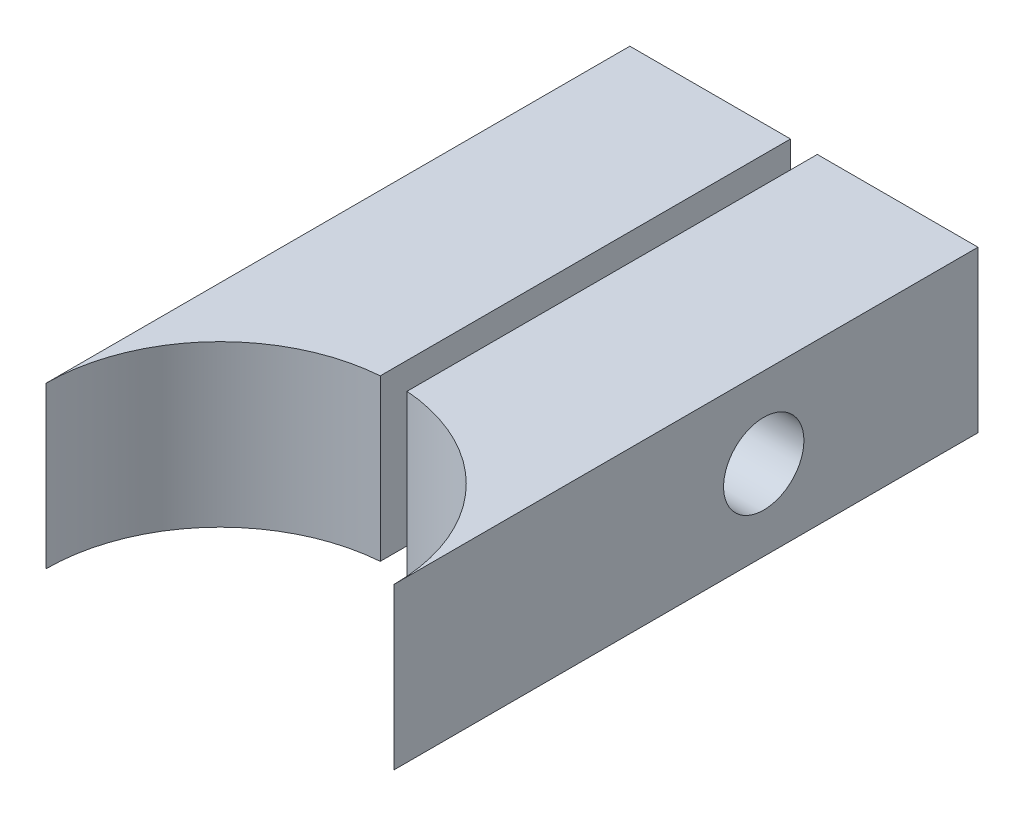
ISO-10303-21;
HEADER;
FILE_DESCRIPTION(('STEP AP214'),'2;1');
FILE_NAME('part.step','',(''),(''),'','','');
FILE_SCHEMA(('AUTOMOTIVE_DESIGN { 1 0 10303 214 1 1 1 1 }'));
ENDSEC;
DATA;
#1=APPLICATION_CONTEXT('core data for automotive mechanical design processes');
#2=APPLICATION_PROTOCOL_DEFINITION('international standard','automotive_design',2000,#1);
#3=PRODUCT_CONTEXT('',#1,'mechanical');
#4=PRODUCT('Part','Part','',(#3));
#5=PRODUCT_RELATED_PRODUCT_CATEGORY('part','',(#4));
#6=PRODUCT_DEFINITION_FORMATION('','',#4);
#7=PRODUCT_DEFINITION_CONTEXT('part definition',#1,'design');
#8=PRODUCT_DEFINITION('design','',#6,#7);
#9=PRODUCT_DEFINITION_SHAPE('','',#8);
#10=(LENGTH_UNIT() NAMED_UNIT(*) SI_UNIT(.MILLI.,.METRE.));
#11=(NAMED_UNIT(*) PLANE_ANGLE_UNIT() SI_UNIT($,.RADIAN.));
#12=(NAMED_UNIT(*) SI_UNIT($,.STERADIAN.) SOLID_ANGLE_UNIT());
#13=UNCERTAINTY_MEASURE_WITH_UNIT(LENGTH_MEASURE(1.E-05),#10,'distance_accuracy_value','');
#14=(GEOMETRIC_REPRESENTATION_CONTEXT(3) GLOBAL_UNCERTAINTY_ASSIGNED_CONTEXT((#13)) GLOBAL_UNIT_ASSIGNED_CONTEXT((#10,
#11,#12)) REPRESENTATION_CONTEXT('',''));
#15=CARTESIAN_POINT('',(0.,0.,0.));
#16=DIRECTION('',(0.,0.,1.));
#17=DIRECTION('',(1.,0.,0.));
#18=AXIS2_PLACEMENT_3D('',#15,#16,#17);
#19=CARTESIAN_POINT('',(20.5288565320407,6.,21.1643132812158));
#20=DIRECTION('',(0.,-1.,0.));
#21=DIRECTION('',(0.,0.,-1.));
#22=AXIS2_PLACEMENT_3D('',#19,#20,#21);
#23=CYLINDRICAL_SURFACE('',#22,6.49999999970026);
#24=CARTESIAN_POINT('',(20.5288565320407,0.,21.1643132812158));
#25=DIRECTION('',(0.,-1.,0.));
#26=DIRECTION('',(0.,0.,1.));
#27=AXIS2_PLACEMENT_3D('',#24,#25,#26);
#28=CIRCLE('',#27,6.49999999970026);
#29=CARTESIAN_POINT('',(21.0288565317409,0.,14.6835725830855));
#30=VERTEX_POINT('',#29);
#31=CARTESIAN_POINT('',(27.0288565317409,0.,21.1643132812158));
#32=VERTEX_POINT('',#31);
#33=EDGE_CURVE('E110',#30,#32,#28,.T.);
#34=ORIENTED_EDGE('',*,*,#33,.T.);
#35=DIRECTION('',(0.,-1.,0.));
#36=VECTOR('',#35,1.);
#37=CARTESIAN_POINT('',(27.0288565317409,6.,21.1643132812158));
#38=LINE('',#37,#36);
#39=CARTESIAN_POINT('',(27.0288565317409,6.,21.1643132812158));
#40=VERTEX_POINT('',#39);
#41=EDGE_CURVE('E12',#40,#32,#38,.T.);
#42=ORIENTED_EDGE('',*,*,#41,.F.);
#43=CARTESIAN_POINT('',(20.5288565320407,6.,21.1643132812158));
#44=DIRECTION('',(0.,-1.,0.));
#45=DIRECTION('',(0.,0.,1.));
#46=AXIS2_PLACEMENT_3D('',#43,#44,#45);
#47=CIRCLE('',#46,6.49999999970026);
#48=CARTESIAN_POINT('',(21.0288565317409,6.,14.6835725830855));
#49=VERTEX_POINT('',#48);
#50=EDGE_CURVE('E97',#49,#40,#47,.T.);
#51=ORIENTED_EDGE('',*,*,#50,.F.);
#52=DIRECTION('',(0.,-1.,0.));
#53=VECTOR('',#52,1.);
#54=CARTESIAN_POINT('',(21.0288565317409,6.,14.6835725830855));
#55=LINE('',#54,#53);
#56=EDGE_CURVE('E106',#49,#30,#55,.T.);
#57=ORIENTED_EDGE('',*,*,#56,.T.);
#58=EDGE_LOOP('',(#34,#42,#51,#57));
#59=FACE_BOUND('',#58,.T.);
#60=ADVANCED_FACE('F45',(#59),#23,.F.);
#61=CARTESIAN_POINT('',(27.0288565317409,6.,21.1643132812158));
#62=DIRECTION('',(-1.,0.,0.));
#63=DIRECTION('',(0.,0.,1.));
#64=AXIS2_PLACEMENT_3D('',#61,#62,#63);
#65=PLANE('',#64);
#66=CARTESIAN_POINT('',(27.0288565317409,3.,7.36454325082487));
#67=DIRECTION('',(1.,0.,0.));
#68=DIRECTION('',(0.,0.,-1.));
#69=AXIS2_PLACEMENT_3D('',#66,#67,#68);
#70=CIRCLE('',#69,1.5);
#71=CARTESIAN_POINT('',(27.0288565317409,3.,5.86454325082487));
#72=VERTEX_POINT('',#71);
#73=EDGE_CURVE('E123',#72,#72,#70,.T.);
#74=ORIENTED_EDGE('',*,*,#73,.F.);
#75=EDGE_LOOP('',(#74));
#76=FACE_BOUND('',#75,.T.);
#77=DIRECTION('',(0.,0.,-1.));
#78=VECTOR('',#77,1.);
#79=CARTESIAN_POINT('',(27.0288565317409,0.,21.1643132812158));
#80=LINE('',#79,#78);
#81=CARTESIAN_POINT('',(27.0288565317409,0.,-0.635456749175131));
#82=VERTEX_POINT('',#81);
#83=EDGE_CURVE('E101',#32,#82,#80,.T.);
#84=ORIENTED_EDGE('',*,*,#83,.T.);
#85=DIRECTION('',(0.,-1.,0.));
#86=VECTOR('',#85,1.);
#87=CARTESIAN_POINT('',(27.0288565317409,6.,-0.635456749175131));
#88=LINE('',#87,#86);
#89=CARTESIAN_POINT('',(27.0288565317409,6.,-0.635456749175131));
#90=VERTEX_POINT('',#89);
#91=EDGE_CURVE('E54',#90,#82,#88,.T.);
#92=ORIENTED_EDGE('',*,*,#91,.F.);
#93=DIRECTION('',(0.,0.,-1.));
#94=VECTOR('',#93,1.);
#95=CARTESIAN_POINT('',(27.0288565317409,6.,21.1643132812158));
#96=LINE('',#95,#94);
#97=EDGE_CURVE('E92',#40,#90,#96,.T.);
#98=ORIENTED_EDGE('',*,*,#97,.F.);
#99=ORIENTED_EDGE('',*,*,#41,.T.);
#100=EDGE_LOOP('',(#84,#92,#98,#99));
#101=FACE_BOUND('',#100,.T.);
#102=ADVANCED_FACE('F100',(#76,#101),#65,.F.);
#103=CARTESIAN_POINT('',(27.0288565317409,6.,-0.635456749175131));
#104=DIRECTION('',(0.,0.,1.));
#105=DIRECTION('',(1.,0.,0.));
#106=AXIS2_PLACEMENT_3D('',#103,#104,#105);
#107=PLANE('',#106);
#108=DIRECTION('',(-1.,0.,0.));
#109=VECTOR('',#108,1.);
#110=CARTESIAN_POINT('',(27.0288565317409,0.,-0.635456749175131));
#111=LINE('',#110,#109);
#112=CARTESIAN_POINT('',(21.0288565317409,0.,-0.635456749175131));
#113=VERTEX_POINT('',#112);
#114=EDGE_CURVE('E79',#82,#113,#111,.T.);
#115=ORIENTED_EDGE('',*,*,#114,.T.);
#116=DIRECTION('',(0.,-1.,0.));
#117=VECTOR('',#116,1.);
#118=CARTESIAN_POINT('',(21.0288565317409,6.,-0.635456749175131));
#119=LINE('',#118,#117);
#120=CARTESIAN_POINT('',(21.0288565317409,6.,-0.635456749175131));
#121=VERTEX_POINT('',#120);
#122=EDGE_CURVE('E102',#121,#113,#119,.T.);
#123=ORIENTED_EDGE('',*,*,#122,.F.);
#124=DIRECTION('',(-1.,0.,0.));
#125=VECTOR('',#124,1.);
#126=CARTESIAN_POINT('',(27.0288565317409,6.,-0.635456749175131));
#127=LINE('',#126,#125);
#128=EDGE_CURVE('E95',#90,#121,#127,.T.);
#129=ORIENTED_EDGE('',*,*,#128,.F.);
#130=ORIENTED_EDGE('',*,*,#91,.T.);
#131=EDGE_LOOP('',(#115,#123,#129,#130));
#132=FACE_BOUND('',#131,.T.);
#133=ADVANCED_FACE('F104',(#132),#107,.F.);
#134=CARTESIAN_POINT('',(21.0288565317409,6.,-0.635456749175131));
#135=DIRECTION('',(1.,0.,0.));
#136=DIRECTION('',(0.,0.,-1.));
#137=AXIS2_PLACEMENT_3D('',#134,#135,#136);
#138=PLANE('',#137);
#139=CARTESIAN_POINT('',(21.0288565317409,3.,7.36454325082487));
#140=DIRECTION('',(1.,0.,0.));
#141=DIRECTION('',(0.,0.,-1.));
#142=AXIS2_PLACEMENT_3D('',#139,#140,#141);
#143=CIRCLE('',#142,1.5);
#144=CARTESIAN_POINT('',(21.0288565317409,3.,5.86454325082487));
#145=VERTEX_POINT('',#144);
#146=EDGE_CURVE('E48',#145,#145,#143,.T.);
#147=ORIENTED_EDGE('',*,*,#146,.T.);
#148=EDGE_LOOP('',(#147));
#149=FACE_BOUND('',#148,.T.);
#150=DIRECTION('',(0.,0.,1.));
#151=VECTOR('',#150,1.);
#152=CARTESIAN_POINT('',(21.0288565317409,0.,-0.635456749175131));
#153=LINE('',#152,#151);
#154=EDGE_CURVE('E85',#113,#30,#153,.T.);
#155=ORIENTED_EDGE('',*,*,#154,.T.);
#156=ORIENTED_EDGE('',*,*,#56,.F.);
#157=DIRECTION('',(0.,0.,1.));
#158=VECTOR('',#157,1.);
#159=CARTESIAN_POINT('',(21.0288565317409,6.,-0.635456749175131));
#160=LINE('',#159,#158);
#161=EDGE_CURVE('E62',#121,#49,#160,.T.);
#162=ORIENTED_EDGE('',*,*,#161,.F.);
#163=ORIENTED_EDGE('',*,*,#122,.T.);
#164=EDGE_LOOP('',(#155,#156,#162,#163));
#165=FACE_BOUND('',#164,.T.);
#166=ADVANCED_FACE('F117',(#149,#165),#138,.F.);
#167=CARTESIAN_POINT('',(20.5288565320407,6.,21.1643132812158));
#168=DIRECTION('',(0.,1.,0.));
#169=DIRECTION('',(0.,0.,1.));
#170=AXIS2_PLACEMENT_3D('',#167,#168,#169);
#171=PLANE('',#170);
#172=ORIENTED_EDGE('',*,*,#50,.T.);
#173=ORIENTED_EDGE('',*,*,#97,.T.);
#174=ORIENTED_EDGE('',*,*,#128,.T.);
#175=ORIENTED_EDGE('',*,*,#161,.T.);
#176=EDGE_LOOP('',(#172,#173,#174,#175));
#177=FACE_BOUND('',#176,.T.);
#178=ADVANCED_FACE('F93',(#177),#171,.T.);
#179=CARTESIAN_POINT('',(20.5288565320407,0.,21.1643132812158));
#180=DIRECTION('',(0.,1.,0.));
#181=DIRECTION('',(0.,0.,1.));
#182=AXIS2_PLACEMENT_3D('',#179,#180,#181);
#183=PLANE('',#182);
#184=ORIENTED_EDGE('',*,*,#33,.F.);
#185=ORIENTED_EDGE('',*,*,#154,.F.);
#186=ORIENTED_EDGE('',*,*,#114,.F.);
#187=ORIENTED_EDGE('',*,*,#83,.F.);
#188=EDGE_LOOP('',(#184,#185,#186,#187));
#189=FACE_BOUND('',#188,.T.);
#190=ADVANCED_FACE('F120',(#189),#183,.F.);
#191=CARTESIAN_POINT('',(12.0288565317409,3.,7.36454325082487));
#192=DIRECTION('',(1.,0.,0.));
#193=DIRECTION('',(0.,0.,-1.));
#194=AXIS2_PLACEMENT_3D('',#191,#192,#193);
#195=CYLINDRICAL_SURFACE('',#194,1.5);
#196=ORIENTED_EDGE('',*,*,#73,.T.);
#197=EDGE_LOOP('',(#196));
#198=FACE_BOUND('',#197,.T.);
#199=ORIENTED_EDGE('',*,*,#146,.F.);
#200=EDGE_LOOP('',(#199));
#201=FACE_BOUND('',#200,.T.);
#202=ADVANCED_FACE('F131',(#198,#201),#195,.F.);
#203=CLOSED_SHELL('',(#60,#102,#133,#166,#178,#190,#202));
#204=MANIFOLD_SOLID_BREP('B2',#203);
#205=CARTESIAN_POINT('',(20.5288565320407,6.,21.1643132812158));
#206=DIRECTION('',(0.,-1.,0.));
#207=DIRECTION('',(0.,0.,-1.));
#208=AXIS2_PLACEMENT_3D('',#205,#206,#207);
#209=CYLINDRICAL_SURFACE('',#208,6.49999999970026);
#210=CARTESIAN_POINT('',(20.5288565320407,0.,21.1643132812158));
#211=DIRECTION('',(0.,-1.,0.));
#212=DIRECTION('',(0.,0.,1.));
#213=AXIS2_PLACEMENT_3D('',#210,#211,#212);
#214=CIRCLE('',#213,6.49999999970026);
#215=CARTESIAN_POINT('',(14.0288565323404,0.,21.1643132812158));
#216=VERTEX_POINT('',#215);
#217=CARTESIAN_POINT('',(20.0288565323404,0.,14.6835725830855));
#218=VERTEX_POINT('',#217);
#219=EDGE_CURVE('E255',#216,#218,#214,.T.);
#220=ORIENTED_EDGE('',*,*,#219,.T.);
#221=DIRECTION('',(0.,-1.,0.));
#222=VECTOR('',#221,1.);
#223=CARTESIAN_POINT('',(20.0288565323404,6.,14.6835725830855));
#224=LINE('',#223,#222);
#225=CARTESIAN_POINT('',(20.0288565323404,6.,14.6835725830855));
#226=VERTEX_POINT('',#225);
#227=EDGE_CURVE('E43',#226,#218,#224,.T.);
#228=ORIENTED_EDGE('',*,*,#227,.F.);
#229=CARTESIAN_POINT('',(20.5288565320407,6.,21.1643132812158));
#230=DIRECTION('',(0.,-1.,0.));
#231=DIRECTION('',(0.,0.,1.));
#232=AXIS2_PLACEMENT_3D('',#229,#230,#231);
#233=CIRCLE('',#232,6.49999999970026);
#234=CARTESIAN_POINT('',(14.0288565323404,6.,21.1643132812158));
#235=VERTEX_POINT('',#234);
#236=EDGE_CURVE('E242',#235,#226,#233,.T.);
#237=ORIENTED_EDGE('',*,*,#236,.F.);
#238=DIRECTION('',(0.,-1.,0.));
#239=VECTOR('',#238,1.);
#240=CARTESIAN_POINT('',(14.0288565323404,6.,21.1643132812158));
#241=LINE('',#240,#239);
#242=EDGE_CURVE('E251',#235,#216,#241,.T.);
#243=ORIENTED_EDGE('',*,*,#242,.T.);
#244=EDGE_LOOP('',(#220,#228,#237,#243));
#245=FACE_BOUND('',#244,.T.);
#246=ADVANCED_FACE('F190',(#245),#209,.F.);
#247=CARTESIAN_POINT('',(20.0288565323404,6.,-0.635456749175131));
#248=DIRECTION('',(-1.,0.,0.));
#249=DIRECTION('',(0.,0.,1.));
#250=AXIS2_PLACEMENT_3D('',#247,#248,#249);
#251=PLANE('',#250);
#252=CARTESIAN_POINT('',(20.0288565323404,3.,7.36454325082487));
#253=DIRECTION('',(-1.,0.,0.));
#254=DIRECTION('',(0.,0.,1.));
#255=AXIS2_PLACEMENT_3D('',#252,#253,#254);
#256=CIRCLE('',#255,1.5);
#257=CARTESIAN_POINT('',(20.0288565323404,3.,8.86454325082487));
#258=VERTEX_POINT('',#257);
#259=EDGE_CURVE('E258',#258,#258,#256,.T.);
#260=ORIENTED_EDGE('',*,*,#259,.T.);
#261=EDGE_LOOP('',(#260));
#262=FACE_BOUND('',#261,.T.);
#263=DIRECTION('',(0.,0.,-1.));
#264=VECTOR('',#263,1.);
#265=CARTESIAN_POINT('',(20.0288565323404,0.,-0.635456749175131));
#266=LINE('',#265,#264);
#267=CARTESIAN_POINT('',(20.0288565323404,0.,-0.635456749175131));
#268=VERTEX_POINT('',#267);
#269=EDGE_CURVE('E246',#218,#268,#266,.T.);
#270=ORIENTED_EDGE('',*,*,#269,.T.);
#271=DIRECTION('',(0.,-1.,0.));
#272=VECTOR('',#271,1.);
#273=CARTESIAN_POINT('',(20.0288565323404,6.,-0.635456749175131));
#274=LINE('',#273,#272);
#275=CARTESIAN_POINT('',(20.0288565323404,6.,-0.635456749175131));
#276=VERTEX_POINT('',#275);
#277=EDGE_CURVE('E199',#276,#268,#274,.T.);
#278=ORIENTED_EDGE('',*,*,#277,.F.);
#279=DIRECTION('',(0.,0.,-1.));
#280=VECTOR('',#279,1.);
#281=CARTESIAN_POINT('',(20.0288565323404,6.,-0.635456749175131));
#282=LINE('',#281,#280);
#283=EDGE_CURVE('E237',#226,#276,#282,.T.);
#284=ORIENTED_EDGE('',*,*,#283,.F.);
#285=ORIENTED_EDGE('',*,*,#227,.T.);
#286=EDGE_LOOP('',(#270,#278,#284,#285));
#287=FACE_BOUND('',#286,.T.);
#288=ADVANCED_FACE('F245',(#262,#287),#251,.F.);
#289=CARTESIAN_POINT('',(14.0288565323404,6.,-0.635456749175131));
#290=DIRECTION('',(0.,0.,1.));
#291=DIRECTION('',(1.,0.,0.));
#292=AXIS2_PLACEMENT_3D('',#289,#290,#291);
#293=PLANE('',#292);
#294=DIRECTION('',(-1.,0.,0.));
#295=VECTOR('',#294,1.);
#296=CARTESIAN_POINT('',(14.0288565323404,0.,-0.635456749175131));
#297=LINE('',#296,#295);
#298=CARTESIAN_POINT('',(14.0288565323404,0.,-0.635456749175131));
#299=VERTEX_POINT('',#298);
#300=EDGE_CURVE('E224',#268,#299,#297,.T.);
#301=ORIENTED_EDGE('',*,*,#300,.T.);
#302=DIRECTION('',(0.,-1.,0.));
#303=VECTOR('',#302,1.);
#304=CARTESIAN_POINT('',(14.0288565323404,6.,-0.635456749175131));
#305=LINE('',#304,#303);
#306=CARTESIAN_POINT('',(14.0288565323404,6.,-0.635456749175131));
#307=VERTEX_POINT('',#306);
#308=EDGE_CURVE('E247',#307,#299,#305,.T.);
#309=ORIENTED_EDGE('',*,*,#308,.F.);
#310=DIRECTION('',(-1.,0.,0.));
#311=VECTOR('',#310,1.);
#312=CARTESIAN_POINT('',(14.0288565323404,6.,-0.635456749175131));
#313=LINE('',#312,#311);
#314=EDGE_CURVE('E240',#276,#307,#313,.T.);
#315=ORIENTED_EDGE('',*,*,#314,.F.);
#316=ORIENTED_EDGE('',*,*,#277,.T.);
#317=EDGE_LOOP('',(#301,#309,#315,#316));
#318=FACE_BOUND('',#317,.T.);
#319=ADVANCED_FACE('F249',(#318),#293,.F.);
#320=CARTESIAN_POINT('',(14.0288565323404,6.,21.1643132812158));
#321=DIRECTION('',(1.,0.,0.));
#322=DIRECTION('',(0.,0.,-1.));
#323=AXIS2_PLACEMENT_3D('',#320,#321,#322);
#324=PLANE('',#323);
#325=CARTESIAN_POINT('',(14.0288565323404,3.,7.36454325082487));
#326=DIRECTION('',(1.,0.,0.));
#327=DIRECTION('',(0.,0.,-1.));
#328=AXIS2_PLACEMENT_3D('',#325,#326,#327);
#329=CIRCLE('',#328,1.5);
#330=CARTESIAN_POINT('',(14.0288565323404,3.,5.86454325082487));
#331=VERTEX_POINT('',#330);
#332=EDGE_CURVE('E193',#331,#331,#329,.T.);
#333=ORIENTED_EDGE('',*,*,#332,.T.);
#334=EDGE_LOOP('',(#333));
#335=FACE_BOUND('',#334,.T.);
#336=DIRECTION('',(0.,0.,1.));
#337=VECTOR('',#336,1.);
#338=CARTESIAN_POINT('',(14.0288565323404,0.,21.1643132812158));
#339=LINE('',#338,#337);
#340=EDGE_CURVE('E230',#299,#216,#339,.T.);
#341=ORIENTED_EDGE('',*,*,#340,.T.);
#342=ORIENTED_EDGE('',*,*,#242,.F.);
#343=DIRECTION('',(0.,0.,1.));
#344=VECTOR('',#343,1.);
#345=CARTESIAN_POINT('',(14.0288565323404,6.,21.1643132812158));
#346=LINE('',#345,#344);
#347=EDGE_CURVE('E207',#307,#235,#346,.T.);
#348=ORIENTED_EDGE('',*,*,#347,.F.);
#349=ORIENTED_EDGE('',*,*,#308,.T.);
#350=EDGE_LOOP('',(#341,#342,#348,#349));
#351=FACE_BOUND('',#350,.T.);
#352=ADVANCED_FACE('F263',(#335,#351),#324,.F.);
#353=CARTESIAN_POINT('',(20.5288565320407,6.,21.1643132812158));
#354=DIRECTION('',(0.,1.,0.));
#355=DIRECTION('',(0.,0.,1.));
#356=AXIS2_PLACEMENT_3D('',#353,#354,#355);
#357=PLANE('',#356);
#358=ORIENTED_EDGE('',*,*,#236,.T.);
#359=ORIENTED_EDGE('',*,*,#283,.T.);
#360=ORIENTED_EDGE('',*,*,#314,.T.);
#361=ORIENTED_EDGE('',*,*,#347,.T.);
#362=EDGE_LOOP('',(#358,#359,#360,#361));
#363=FACE_BOUND('',#362,.T.);
#364=ADVANCED_FACE('F238',(#363),#357,.T.);
#365=CARTESIAN_POINT('',(20.5288565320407,0.,21.1643132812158));
#366=DIRECTION('',(0.,1.,0.));
#367=DIRECTION('',(0.,0.,1.));
#368=AXIS2_PLACEMENT_3D('',#365,#366,#367);
#369=PLANE('',#368);
#370=ORIENTED_EDGE('',*,*,#219,.F.);
#371=ORIENTED_EDGE('',*,*,#340,.F.);
#372=ORIENTED_EDGE('',*,*,#300,.F.);
#373=ORIENTED_EDGE('',*,*,#269,.F.);
#374=EDGE_LOOP('',(#370,#371,#372,#373));
#375=FACE_BOUND('',#374,.T.);
#376=ADVANCED_FACE('F266',(#375),#369,.F.);
#377=CARTESIAN_POINT('',(12.0288565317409,3.,7.36454325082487));
#378=DIRECTION('',(1.,0.,0.));
#379=DIRECTION('',(0.,0.,-1.));
#380=AXIS2_PLACEMENT_3D('',#377,#378,#379);
#381=CYLINDRICAL_SURFACE('',#380,1.5);
#382=ORIENTED_EDGE('',*,*,#332,.F.);
#383=EDGE_LOOP('',(#382));
#384=FACE_BOUND('',#383,.T.);
#385=ORIENTED_EDGE('',*,*,#259,.F.);
#386=EDGE_LOOP('',(#385));
#387=FACE_BOUND('',#386,.T.);
#388=ADVANCED_FACE('F276',(#384,#387),#381,.F.);
#389=CLOSED_SHELL('',(#246,#288,#319,#352,#364,#376,#388));
#390=MANIFOLD_SOLID_BREP('B6',#389);
#391=ADVANCED_BREP_SHAPE_REPRESENTATION('',(#18,#204,#390),#14);
#392=SHAPE_DEFINITION_REPRESENTATION(#9,#391);
ENDSEC;
END-ISO-10303-21;
